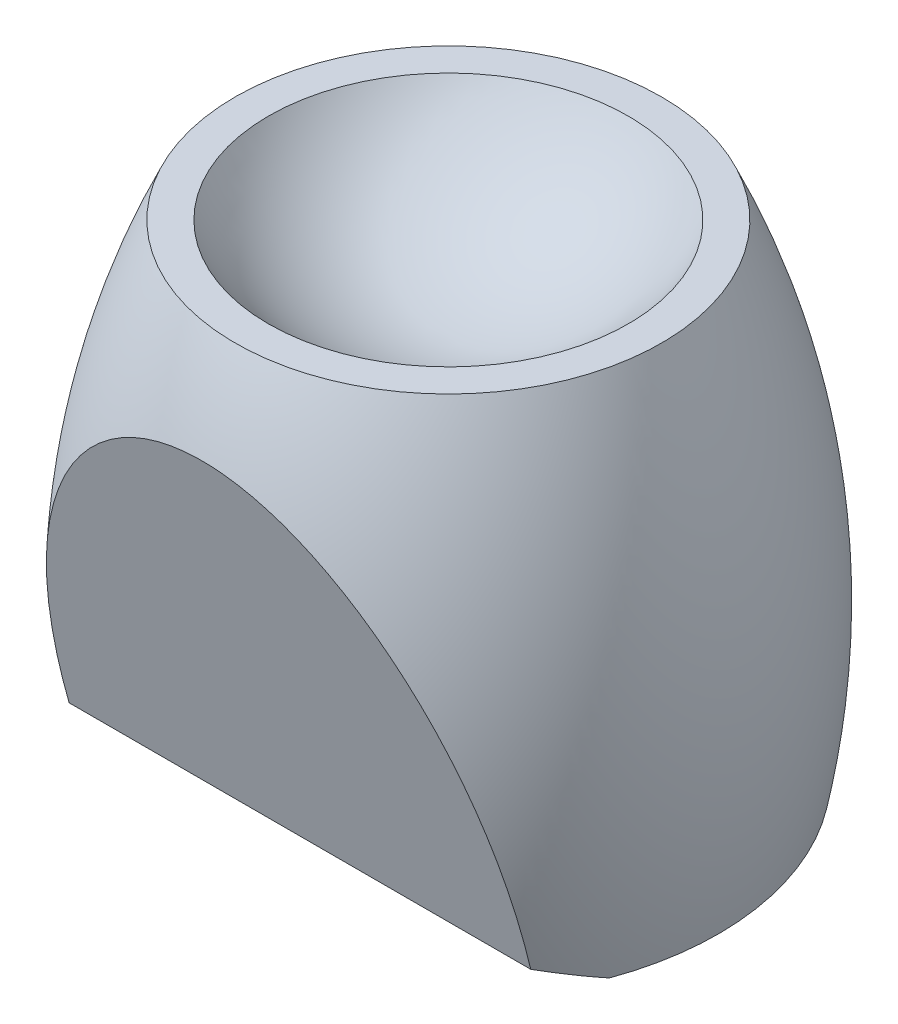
from build123d import *

# Parameters (mm, degrees)
ZKOSIT1_SIZE  = 20
ZKOSIT1_SIZE2 = 10


with BuildPart() as part:
    # Skica1 → Oto_it kolem osy1 (revolve)
    with BuildSketch(Plane.XY, mode=Mode.PRIVATE) as oto_it_kolem_osy1_sk:
        with BuildLine():
            Line((0, 0), (0, 195.5))
            Line((0, 195.5), (86.25, 195.5))
            ThreePointArc((86.25, 195.5), (113.156167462, 99.56249029), (109.25, 0))
            Line((109.25, 0), (0, 0))
        make_face()
    revolve(oto_it_kolem_osy1_sk.sketch.rotate(Axis((0, 195.5, 0), (0, 1, 0)), 90), axis=Axis((0, 195.5, 0), (0, 1, 0)))

    # Odebrat povrchem1
    split(bisect_by=Plane(origin=(0, -14.104042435, 53.802714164), x_dir=(-1, 0, 0), z_dir=(0, 0.2535756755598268, -0.9673155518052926)), keep=Keep.TOP)

    # Odebrat povrchem2
    split(bisect_by=Plane(origin=(0, -46.135524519, -46.135524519), x_dir=(-1, 0, 0), z_dir=(-3.6087953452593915e-15, 0.7071067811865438, 0.7071067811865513)), keep=Keep.TOP)

    # Skica6 → Odebrat oto_en_m1 (revolve, cut)
    with BuildSketch(Plane.XY):
        with BuildLine():
            Line((74.75, -37.375), (74.75, 11.5))
            ThreePointArc((74.75, 11.5), (109.30984393, -2.81515607), (123.625, -37.375))
            Line((123.625, -37.375), (74.75, -37.375))
        make_face()
    odebrat_oto_en_m1 = revolve(axis=Axis((74.75, -37.375, 0), (0, 1, 0)), mode=Mode.SUBTRACT)

    # Zrcadlit1: Odebrat oto_en_m1 across plane
    add(odebrat_oto_en_m1.mirror(Plane(origin=(0, 0, 0), x_dir=(0, 0, 1), z_dir=(1, 0, 0))), mode=Mode.SUBTRACT)

    # Skica7 → Odebrat oto_en_m2 (revolve, cut)
    with BuildSketch(Plane.XY, mode=Mode.PRIVATE) as odebrat_oto_en_m2_sk:
        with BuildLine():
            Line((0, 155.5), (0, 241.75))
            Line((0, 241.75), (-86.25, 241.75))
            ThreePointArc((-86.25, 241.75), (-60.987959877, 180.762040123), (0, 155.5))
        make_face()
    revolve(odebrat_oto_en_m2_sk.sketch.rotate(Axis((0, 155.5, 0), (0, 1, 0)), 31.756863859), axis=Axis((0, 155.5, 0), (0, 1, 0)), mode=Mode.SUBTRACT)

    # Zkosit1
    zkosit1_edges = [part.edges().sort_by_distance(p)[0] for p in [
        (0, 0, 57.5),
    ]]
    zkosit1_side = [part.faces().sort_by_distance(p)[0] for p in [
        (0, 0, -17.338251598),
    ]]
    chamfer(zkosit1_edges, length=ZKOSIT1_SIZE, length2=ZKOSIT1_SIZE2, reference=zkosit1_side[0])


solid = part.part
